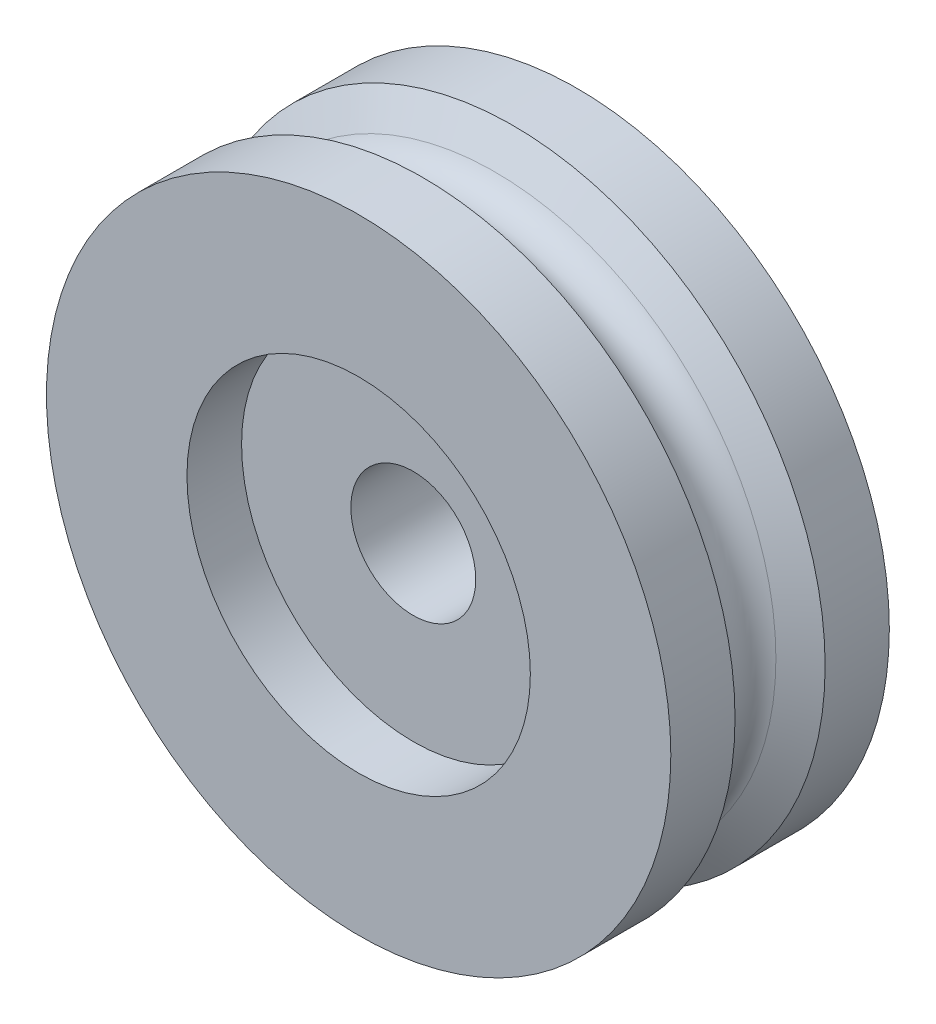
ISO-10303-21;
HEADER;
FILE_DESCRIPTION(('STEP AP214'),'2;1');
FILE_NAME('part.step','',(''),(''),'','','');
FILE_SCHEMA(('AUTOMOTIVE_DESIGN { 1 0 10303 214 1 1 1 1 }'));
ENDSEC;
DATA;
#1=APPLICATION_CONTEXT('core data for automotive mechanical design processes');
#2=APPLICATION_PROTOCOL_DEFINITION('international standard','automotive_design',2000,#1);
#3=PRODUCT_CONTEXT('',#1,'mechanical');
#4=PRODUCT('Part','Part','',(#3));
#5=PRODUCT_RELATED_PRODUCT_CATEGORY('part','',(#4));
#6=PRODUCT_DEFINITION_FORMATION('','',#4);
#7=PRODUCT_DEFINITION_CONTEXT('part definition',#1,'design');
#8=PRODUCT_DEFINITION('design','',#6,#7);
#9=PRODUCT_DEFINITION_SHAPE('','',#8);
#10=(LENGTH_UNIT() NAMED_UNIT(*) SI_UNIT(.MILLI.,.METRE.));
#11=(NAMED_UNIT(*) PLANE_ANGLE_UNIT() SI_UNIT($,.RADIAN.));
#12=(NAMED_UNIT(*) SI_UNIT($,.STERADIAN.) SOLID_ANGLE_UNIT());
#13=UNCERTAINTY_MEASURE_WITH_UNIT(LENGTH_MEASURE(1.E-05),#10,'distance_accuracy_value','');
#14=(GEOMETRIC_REPRESENTATION_CONTEXT(3) GLOBAL_UNCERTAINTY_ASSIGNED_CONTEXT((#13)) GLOBAL_UNIT_ASSIGNED_CONTEXT((#10,
#11,#12)) REPRESENTATION_CONTEXT('',''));
#15=CARTESIAN_POINT('',(0.,0.,0.));
#16=DIRECTION('',(0.,0.,1.));
#17=DIRECTION('',(1.,0.,0.));
#18=AXIS2_PLACEMENT_3D('',#15,#16,#17);
#19=CARTESIAN_POINT('',(0.,0.,-2.8867513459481));
#20=DIRECTION('',(0.,0.,-1.));
#21=DIRECTION('',(-1.,0.,0.));
#22=AXIS2_PLACEMENT_3D('',#19,#20,#21);
#23=CONICAL_SURFACE('',#22,20.,1.04719755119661);
#24=CARTESIAN_POINT('',(0.,0.,-1.73205080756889));
#25=DIRECTION('',(0.,0.,1.));
#26=DIRECTION('',(1.,0.,0.));
#27=AXIS2_PLACEMENT_3D('',#24,#25,#26);
#28=CIRCLE('',#27,18.);
#29=CARTESIAN_POINT('',(18.,0.,-1.73205080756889));
#30=VERTEX_POINT('',#29);
#31=EDGE_CURVE('E8',#30,#30,#28,.T.);
#32=ORIENTED_EDGE('',*,*,#31,.F.);
#33=EDGE_LOOP('',(#32));
#34=FACE_BOUND('',#33,.T.);
#35=CARTESIAN_POINT('',(0.,0.,-2.8867513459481));
#36=DIRECTION('',(0.,0.,1.));
#37=DIRECTION('',(1.,0.,0.));
#38=AXIS2_PLACEMENT_3D('',#35,#36,#37);
#39=CIRCLE('',#38,20.);
#40=CARTESIAN_POINT('',(20.,0.,-2.8867513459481));
#41=VERTEX_POINT('',#40);
#42=EDGE_CURVE('E52',#41,#41,#39,.T.);
#43=ORIENTED_EDGE('',*,*,#42,.T.);
#44=EDGE_LOOP('',(#43));
#45=FACE_BOUND('',#44,.T.);
#46=ADVANCED_FACE('F12',(#34,#45),#23,.T.);
#47=CARTESIAN_POINT('',(0.,0.,0.));
#48=DIRECTION('',(0.,0.,1.));
#49=DIRECTION('',(1.,0.,0.));
#50=AXIS2_PLACEMENT_3D('',#47,#48,#49);
#51=TOROIDAL_SURFACE('',#50,19.,2.);
#52=CARTESIAN_POINT('',(0.,0.,1.73205080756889));
#53=DIRECTION('',(0.,0.,1.));
#54=DIRECTION('',(1.,0.,0.));
#55=AXIS2_PLACEMENT_3D('',#52,#53,#54);
#56=CIRCLE('',#55,18.);
#57=CARTESIAN_POINT('',(18.,0.,1.73205080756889));
#58=VERTEX_POINT('',#57);
#59=EDGE_CURVE('E18',#58,#58,#56,.T.);
#60=ORIENTED_EDGE('',*,*,#59,.F.);
#61=EDGE_LOOP('',(#60));
#62=FACE_BOUND('',#61,.T.);
#63=ORIENTED_EDGE('',*,*,#31,.T.);
#64=EDGE_LOOP('',(#63));
#65=FACE_BOUND('',#64,.T.);
#66=ADVANCED_FACE('F113',(#62,#65),#51,.F.);
#67=CARTESIAN_POINT('',(0.,0.,1.73205080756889));
#68=DIRECTION('',(0.,0.,1.));
#69=DIRECTION('',(1.,0.,0.));
#70=AXIS2_PLACEMENT_3D('',#67,#68,#69);
#71=CONICAL_SURFACE('',#70,18.,1.04719755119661);
#72=CARTESIAN_POINT('',(0.,0.,2.88675134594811));
#73=DIRECTION('',(0.,0.,1.));
#74=DIRECTION('',(1.,0.,0.));
#75=AXIS2_PLACEMENT_3D('',#72,#73,#74);
#76=CIRCLE('',#75,20.);
#77=CARTESIAN_POINT('',(20.,0.,2.88675134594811));
#78=VERTEX_POINT('',#77);
#79=EDGE_CURVE('E22',#78,#78,#76,.T.);
#80=ORIENTED_EDGE('',*,*,#79,.F.);
#81=EDGE_LOOP('',(#80));
#82=FACE_BOUND('',#81,.T.);
#83=ORIENTED_EDGE('',*,*,#59,.T.);
#84=EDGE_LOOP('',(#83));
#85=FACE_BOUND('',#84,.T.);
#86=ADVANCED_FACE('F108',(#82,#85),#71,.T.);
#87=CARTESIAN_POINT('',(0.,0.,7.5891940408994));
#88=DIRECTION('',(0.,0.,1.));
#89=DIRECTION('',(1.,0.,0.));
#90=AXIS2_PLACEMENT_3D('',#87,#88,#89);
#91=CYLINDRICAL_SURFACE('',#90,20.);
#92=CARTESIAN_POINT('',(0.,0.,7.));
#93=DIRECTION('',(0.,0.,1.));
#94=DIRECTION('',(1.,0.,0.));
#95=AXIS2_PLACEMENT_3D('',#92,#93,#94);
#96=CIRCLE('',#95,20.);
#97=CARTESIAN_POINT('',(20.,0.,7.));
#98=VERTEX_POINT('',#97);
#99=EDGE_CURVE('E26',#98,#98,#96,.T.);
#100=ORIENTED_EDGE('',*,*,#99,.F.);
#101=EDGE_LOOP('',(#100));
#102=FACE_BOUND('',#101,.T.);
#103=ORIENTED_EDGE('',*,*,#79,.T.);
#104=EDGE_LOOP('',(#103));
#105=FACE_BOUND('',#104,.T.);
#106=ADVANCED_FACE('F102',(#102,#105),#91,.T.);
#107=CARTESIAN_POINT('',(0.,20.,7.));
#108=DIRECTION('',(0.,0.,-1.));
#109=DIRECTION('',(-1.,0.,0.));
#110=AXIS2_PLACEMENT_3D('',#107,#108,#109);
#111=PLANE('',#110);
#112=CARTESIAN_POINT('',(0.,0.,7.));
#113=DIRECTION('',(0.,0.,1.));
#114=DIRECTION('',(1.,0.,0.));
#115=AXIS2_PLACEMENT_3D('',#112,#113,#114);
#116=CIRCLE('',#115,11.);
#117=CARTESIAN_POINT('',(11.,0.,7.));
#118=VERTEX_POINT('',#117);
#119=EDGE_CURVE('E31',#118,#118,#116,.T.);
#120=ORIENTED_EDGE('',*,*,#119,.F.);
#121=EDGE_LOOP('',(#120));
#122=FACE_BOUND('',#121,.T.);
#123=ORIENTED_EDGE('',*,*,#99,.T.);
#124=EDGE_LOOP('',(#123));
#125=FACE_BOUND('',#124,.T.);
#126=ADVANCED_FACE('F96',(#122,#125),#111,.F.);
#127=CARTESIAN_POINT('',(0.,0.,7.5891940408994));
#128=DIRECTION('',(0.,0.,1.));
#129=DIRECTION('',(1.,0.,0.));
#130=AXIS2_PLACEMENT_3D('',#127,#128,#129);
#131=CYLINDRICAL_SURFACE('',#130,11.);
#132=CARTESIAN_POINT('',(0.,0.,3.5));
#133=DIRECTION('',(0.,0.,1.));
#134=DIRECTION('',(1.,0.,0.));
#135=AXIS2_PLACEMENT_3D('',#132,#133,#134);
#136=CIRCLE('',#135,11.);
#137=CARTESIAN_POINT('',(11.,0.,3.5));
#138=VERTEX_POINT('',#137);
#139=EDGE_CURVE('E34',#138,#138,#136,.T.);
#140=ORIENTED_EDGE('',*,*,#139,.F.);
#141=EDGE_LOOP('',(#140));
#142=FACE_BOUND('',#141,.T.);
#143=ORIENTED_EDGE('',*,*,#119,.T.);
#144=EDGE_LOOP('',(#143));
#145=FACE_BOUND('',#144,.T.);
#146=ADVANCED_FACE('F90',(#142,#145),#131,.F.);
#147=CARTESIAN_POINT('',(0.,11.,3.5));
#148=DIRECTION('',(0.,0.,-1.));
#149=DIRECTION('',(-1.,0.,0.));
#150=AXIS2_PLACEMENT_3D('',#147,#148,#149);
#151=PLANE('',#150);
#152=CARTESIAN_POINT('',(0.,0.,3.5));
#153=DIRECTION('',(0.,0.,1.));
#154=DIRECTION('',(1.,0.,0.));
#155=AXIS2_PLACEMENT_3D('',#152,#153,#154);
#156=CIRCLE('',#155,4.);
#157=CARTESIAN_POINT('',(4.,0.,3.5));
#158=VERTEX_POINT('',#157);
#159=EDGE_CURVE('E37',#158,#158,#156,.T.);
#160=ORIENTED_EDGE('',*,*,#159,.F.);
#161=EDGE_LOOP('',(#160));
#162=FACE_BOUND('',#161,.T.);
#163=ORIENTED_EDGE('',*,*,#139,.T.);
#164=EDGE_LOOP('',(#163));
#165=FACE_BOUND('',#164,.T.);
#166=ADVANCED_FACE('F84',(#162,#165),#151,.F.);
#167=CARTESIAN_POINT('',(0.,0.,7.5891940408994));
#168=DIRECTION('',(0.,0.,1.));
#169=DIRECTION('',(1.,0.,0.));
#170=AXIS2_PLACEMENT_3D('',#167,#168,#169);
#171=CYLINDRICAL_SURFACE('',#170,4.);
#172=CARTESIAN_POINT('',(0.,0.,-3.5));
#173=DIRECTION('',(0.,0.,1.));
#174=DIRECTION('',(1.,0.,0.));
#175=AXIS2_PLACEMENT_3D('',#172,#173,#174);
#176=CIRCLE('',#175,4.);
#177=CARTESIAN_POINT('',(4.,0.,-3.5));
#178=VERTEX_POINT('',#177);
#179=EDGE_CURVE('E40',#178,#178,#176,.T.);
#180=ORIENTED_EDGE('',*,*,#179,.F.);
#181=EDGE_LOOP('',(#180));
#182=FACE_BOUND('',#181,.T.);
#183=ORIENTED_EDGE('',*,*,#159,.T.);
#184=EDGE_LOOP('',(#183));
#185=FACE_BOUND('',#184,.T.);
#186=ADVANCED_FACE('F78',(#182,#185),#171,.F.);
#187=CARTESIAN_POINT('',(0.,4.,-3.5));
#188=DIRECTION('',(0.,0.,1.));
#189=DIRECTION('',(1.,0.,0.));
#190=AXIS2_PLACEMENT_3D('',#187,#188,#189);
#191=PLANE('',#190);
#192=CARTESIAN_POINT('',(0.,0.,-3.5));
#193=DIRECTION('',(0.,0.,1.));
#194=DIRECTION('',(1.,0.,0.));
#195=AXIS2_PLACEMENT_3D('',#192,#193,#194);
#196=CIRCLE('',#195,9.);
#197=CARTESIAN_POINT('',(9.,0.,-3.5));
#198=VERTEX_POINT('',#197);
#199=EDGE_CURVE('E43',#198,#198,#196,.T.);
#200=ORIENTED_EDGE('',*,*,#199,.F.);
#201=EDGE_LOOP('',(#200));
#202=FACE_BOUND('',#201,.T.);
#203=ORIENTED_EDGE('',*,*,#179,.T.);
#204=EDGE_LOOP('',(#203));
#205=FACE_BOUND('',#204,.T.);
#206=ADVANCED_FACE('F72',(#202,#205),#191,.F.);
#207=CARTESIAN_POINT('',(0.,0.,7.5891940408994));
#208=DIRECTION('',(0.,0.,1.));
#209=DIRECTION('',(1.,0.,0.));
#210=AXIS2_PLACEMENT_3D('',#207,#208,#209);
#211=CYLINDRICAL_SURFACE('',#210,9.);
#212=CARTESIAN_POINT('',(0.,0.,-7.));
#213=DIRECTION('',(0.,0.,1.));
#214=DIRECTION('',(1.,0.,0.));
#215=AXIS2_PLACEMENT_3D('',#212,#213,#214);
#216=CIRCLE('',#215,9.);
#217=CARTESIAN_POINT('',(9.,0.,-7.));
#218=VERTEX_POINT('',#217);
#219=EDGE_CURVE('E46',#218,#218,#216,.T.);
#220=ORIENTED_EDGE('',*,*,#219,.F.);
#221=EDGE_LOOP('',(#220));
#222=FACE_BOUND('',#221,.T.);
#223=ORIENTED_EDGE('',*,*,#199,.T.);
#224=EDGE_LOOP('',(#223));
#225=FACE_BOUND('',#224,.T.);
#226=ADVANCED_FACE('F66',(#222,#225),#211,.F.);
#227=CARTESIAN_POINT('',(0.,9.,-7.));
#228=DIRECTION('',(0.,0.,1.));
#229=DIRECTION('',(1.,0.,0.));
#230=AXIS2_PLACEMENT_3D('',#227,#228,#229);
#231=PLANE('',#230);
#232=CARTESIAN_POINT('',(0.,0.,-7.));
#233=DIRECTION('',(0.,0.,1.));
#234=DIRECTION('',(1.,0.,0.));
#235=AXIS2_PLACEMENT_3D('',#232,#233,#234);
#236=CIRCLE('',#235,20.);
#237=CARTESIAN_POINT('',(20.,0.,-7.));
#238=VERTEX_POINT('',#237);
#239=EDGE_CURVE('E49',#238,#238,#236,.T.);
#240=ORIENTED_EDGE('',*,*,#239,.F.);
#241=EDGE_LOOP('',(#240));
#242=FACE_BOUND('',#241,.T.);
#243=ORIENTED_EDGE('',*,*,#219,.T.);
#244=EDGE_LOOP('',(#243));
#245=FACE_BOUND('',#244,.T.);
#246=ADVANCED_FACE('F60',(#242,#245),#231,.F.);
#247=CARTESIAN_POINT('',(0.,0.,7.5891940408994));
#248=DIRECTION('',(0.,0.,1.));
#249=DIRECTION('',(1.,0.,0.));
#250=AXIS2_PLACEMENT_3D('',#247,#248,#249);
#251=CYLINDRICAL_SURFACE('',#250,20.);
#252=ORIENTED_EDGE('',*,*,#42,.F.);
#253=EDGE_LOOP('',(#252));
#254=FACE_BOUND('',#253,.T.);
#255=ORIENTED_EDGE('',*,*,#239,.T.);
#256=EDGE_LOOP('',(#255));
#257=FACE_BOUND('',#256,.T.);
#258=ADVANCED_FACE('F57',(#254,#257),#251,.T.);
#259=CLOSED_SHELL('',(#46,#66,#86,#106,#126,#146,#166,#186,#206,#226,#246,#258));
#260=MANIFOLD_SOLID_BREP('B1',#259);
#261=ADVANCED_BREP_SHAPE_REPRESENTATION('',(#18,#260),#14);
#262=SHAPE_DEFINITION_REPRESENTATION(#9,#261);
ENDSEC;
END-ISO-10303-21;
